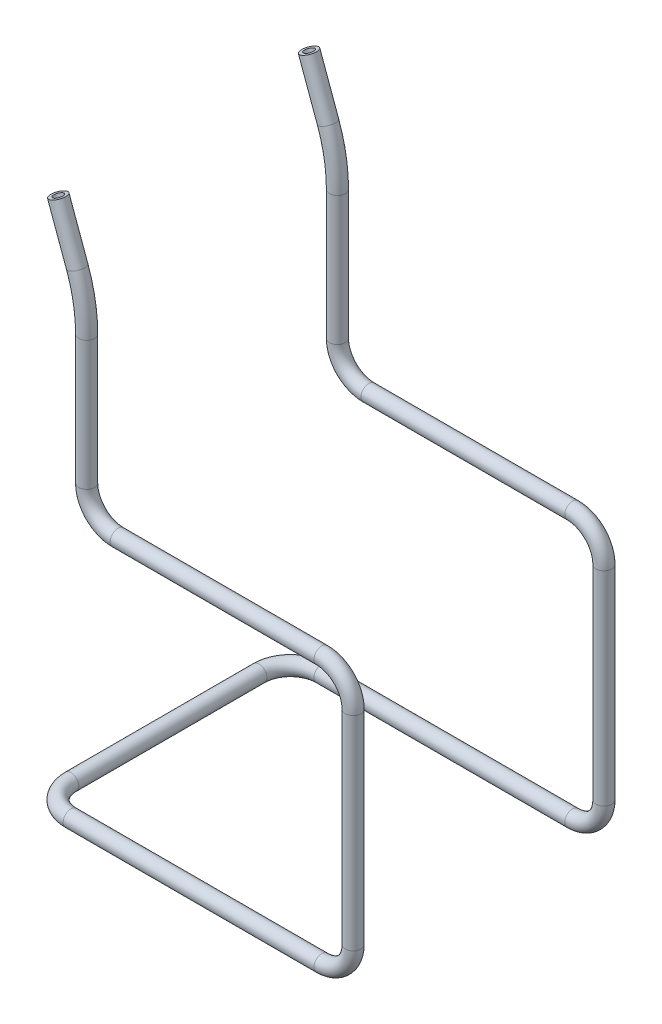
from build123d import *

# Parameters (mm, degrees)
SKETCH1_R   = 2.5
SKETCH1_R_2 = 1.5


with BuildPart() as part:
    # Sweep-Thin1: sweep along a curve in space
    with BuildLine() as sweep_thin1_path:
        Line((0, 0, 0), (0, 0, 30))
        ThreePointArc((0, 0, 30), (2.928932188, 0, 37.071067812), (10, 0, 40))
        Line((10, 0, 40), (90, 0, 40))
        ThreePointArc((90, 0, 40), (97.071067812, 2.928932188, 40), (100, 10, 40))
        Line((100, 10, 40), (100, 75, 40))
        ThreePointArc((100, 75, 40), (97.071067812, 82.071067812, 40), (90, 85, 40))
        Line((90, 85, 40), (25, 85, 40))
        ThreePointArc((25, 85, 40), (17.928932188, 87.928932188, 40), (15, 95, 40))
        Line((15, 95, 40), (15, 136.17811304, 40))
        ThreePointArc((15, 136.17811304, 40), (14.240387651, 144.860521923, 40), (11.984631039, 153.279120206, 40))
        Line((11.984631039, 153.279120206, 40), (5.936466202, 169.896316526, 40))
    # Sketch1 → Sweep-Thin1 (sweep)
    with BuildSketch(Plane.XY):
        Circle(SKETCH1_R)
        Circle(SKETCH1_R_2, mode=Mode.SUBTRACT)
    sweep_thin1 = sweep(path=sweep_thin1_path.line)

    # Mirror1: Sweep-Thin1 across plane
    add(sweep_thin1.mirror(Plane.XY))


solid = part.part
